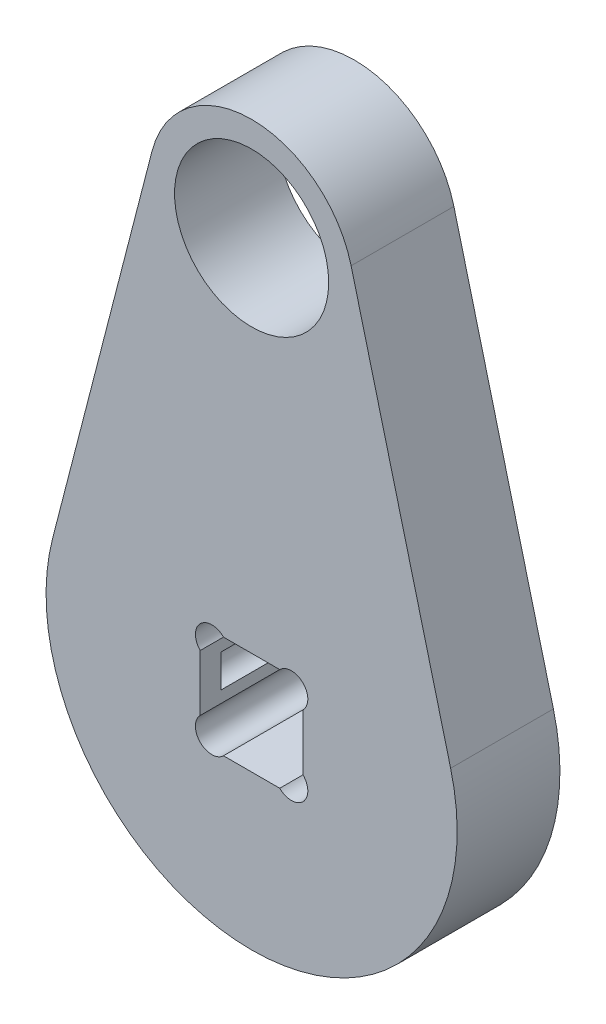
ISO-10303-21;
HEADER;
FILE_DESCRIPTION(('STEP AP214'),'2;1');
FILE_NAME('part.step','',(''),(''),'','','');
FILE_SCHEMA(('AUTOMOTIVE_DESIGN { 1 0 10303 214 1 1 1 1 }'));
ENDSEC;
DATA;
#1=APPLICATION_CONTEXT('core data for automotive mechanical design processes');
#2=APPLICATION_PROTOCOL_DEFINITION('international standard','automotive_design',2000,#1);
#3=PRODUCT_CONTEXT('',#1,'mechanical');
#4=PRODUCT('Part','Part','',(#3));
#5=PRODUCT_RELATED_PRODUCT_CATEGORY('part','',(#4));
#6=PRODUCT_DEFINITION_FORMATION('','',#4);
#7=PRODUCT_DEFINITION_CONTEXT('part definition',#1,'design');
#8=PRODUCT_DEFINITION('design','',#6,#7);
#9=PRODUCT_DEFINITION_SHAPE('','',#8);
#10=(LENGTH_UNIT() NAMED_UNIT(*) SI_UNIT(.MILLI.,.METRE.));
#11=(NAMED_UNIT(*) PLANE_ANGLE_UNIT() SI_UNIT($,.RADIAN.));
#12=(NAMED_UNIT(*) SI_UNIT($,.STERADIAN.) SOLID_ANGLE_UNIT());
#13=UNCERTAINTY_MEASURE_WITH_UNIT(LENGTH_MEASURE(1.E-05),#10,'distance_accuracy_value','');
#14=(GEOMETRIC_REPRESENTATION_CONTEXT(3) GLOBAL_UNCERTAINTY_ASSIGNED_CONTEXT((#13)) GLOBAL_UNIT_ASSIGNED_CONTEXT((#10,
#11,#12)) REPRESENTATION_CONTEXT('',''));
#15=CARTESIAN_POINT('',(0.,0.,0.));
#16=DIRECTION('',(0.,0.,1.));
#17=DIRECTION('',(1.,0.,0.));
#18=AXIS2_PLACEMENT_3D('',#15,#16,#17);
#19=CARTESIAN_POINT('',(0.,40.,10.));
#20=DIRECTION('',(0.,0.,1.));
#21=DIRECTION('',(1.,0.,0.));
#22=AXIS2_PLACEMENT_3D('',#19,#20,#21);
#23=PLANE('',#22);
#24=CARTESIAN_POINT('',(3.86862915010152,3.86862915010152,10.));
#25=DIRECTION('',(0.,0.,-1.));
#26=DIRECTION('',(-1.,0.,0.));
#27=AXIS2_PLACEMENT_3D('',#24,#25,#26);
#28=CIRCLE('',#27,1.6);
#29=CARTESIAN_POINT('',(2.73725830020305,5.,10.));
#30=VERTEX_POINT('',#29);
#31=CARTESIAN_POINT('',(5.,2.73725830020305,10.));
#32=VERTEX_POINT('',#31);
#33=EDGE_CURVE('E176',#30,#32,#28,.T.);
#34=ORIENTED_EDGE('',*,*,#33,.T.);
#35=DIRECTION('',(0.,-1.,0.));
#36=VECTOR('',#35,1.);
#37=CARTESIAN_POINT('',(5.,2.73725830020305,10.));
#38=LINE('',#37,#36);
#39=CARTESIAN_POINT('',(5.,-2.73725830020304,10.));
#40=VERTEX_POINT('',#39);
#41=EDGE_CURVE('E361',#32,#40,#38,.T.);
#42=ORIENTED_EDGE('',*,*,#41,.T.);
#43=CARTESIAN_POINT('',(3.86862915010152,-3.86862915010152,10.));
#44=DIRECTION('',(0.,0.,-1.));
#45=DIRECTION('',(1.,0.,0.));
#46=AXIS2_PLACEMENT_3D('',#43,#44,#45);
#47=CIRCLE('',#46,1.6);
#48=CARTESIAN_POINT('',(2.73725830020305,-5.,10.));
#49=VERTEX_POINT('',#48);
#50=EDGE_CURVE('E359',#40,#49,#47,.T.);
#51=ORIENTED_EDGE('',*,*,#50,.T.);
#52=DIRECTION('',(-1.,0.,0.));
#53=VECTOR('',#52,1.);
#54=CARTESIAN_POINT('',(2.73725830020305,-5.,10.));
#55=LINE('',#54,#53);
#56=CARTESIAN_POINT('',(-2.73725830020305,-5.,10.));
#57=VERTEX_POINT('',#56);
#58=EDGE_CURVE('E366',#49,#57,#55,.T.);
#59=ORIENTED_EDGE('',*,*,#58,.T.);
#60=CARTESIAN_POINT('',(-3.86862915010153,-3.86862915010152,10.));
#61=DIRECTION('',(0.,0.,-1.));
#62=DIRECTION('',(-1.,0.,0.));
#63=AXIS2_PLACEMENT_3D('',#60,#61,#62);
#64=CIRCLE('',#63,1.6);
#65=CARTESIAN_POINT('',(-5.,-2.73725830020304,10.));
#66=VERTEX_POINT('',#65);
#67=EDGE_CURVE('E372',#57,#66,#64,.T.);
#68=ORIENTED_EDGE('',*,*,#67,.T.);
#69=DIRECTION('',(0.,1.,0.));
#70=VECTOR('',#69,1.);
#71=CARTESIAN_POINT('',(-5.,2.73725830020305,10.));
#72=LINE('',#71,#70);
#73=CARTESIAN_POINT('',(-5.,2.73725830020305,10.));
#74=VERTEX_POINT('',#73);
#75=EDGE_CURVE('E375',#66,#74,#72,.T.);
#76=ORIENTED_EDGE('',*,*,#75,.T.);
#77=CARTESIAN_POINT('',(-3.86862915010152,3.86862915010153,10.));
#78=DIRECTION('',(0.,0.,-1.));
#79=DIRECTION('',(1.,0.,0.));
#80=AXIS2_PLACEMENT_3D('',#77,#78,#79);
#81=CIRCLE('',#80,1.6);
#82=CARTESIAN_POINT('',(-2.73725830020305,5.,10.));
#83=VERTEX_POINT('',#82);
#84=EDGE_CURVE('E378',#74,#83,#81,.T.);
#85=ORIENTED_EDGE('',*,*,#84,.T.);
#86=DIRECTION('',(1.,0.,0.));
#87=VECTOR('',#86,1.);
#88=CARTESIAN_POINT('',(2.73725830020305,5.,10.));
#89=LINE('',#88,#87);
#90=EDGE_CURVE('E196',#83,#30,#89,.T.);
#91=ORIENTED_EDGE('',*,*,#90,.T.);
#92=EDGE_LOOP('',(#34,#42,#51,#59,#68,#76,#85,#91));
#93=FACE_BOUND('',#92,.T.);
#94=CARTESIAN_POINT('',(0.,40.,10.));
#95=DIRECTION('',(0.,0.,1.));
#96=DIRECTION('',(1.,0.,0.));
#97=AXIS2_PLACEMENT_3D('',#94,#95,#96);
#98=CIRCLE('',#97,10.0000000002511);
#99=CARTESIAN_POINT('',(9.68245836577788,42.5,10.));
#100=VERTEX_POINT('',#99);
#101=CARTESIAN_POINT('',(-9.68245836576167,42.5000000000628,10.));
#102=VERTEX_POINT('',#101);
#103=EDGE_CURVE('E203',#100,#102,#98,.T.);
#104=ORIENTED_EDGE('',*,*,#103,.T.);
#105=DIRECTION('',(-0.249999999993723,-0.968245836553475,0.));
#106=VECTOR('',#105,1.);
#107=CARTESIAN_POINT('',(-9.68245836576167,42.5000000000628,10.));
#108=LINE('',#107,#106);
#109=CARTESIAN_POINT('',(-19.3649167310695,4.99999999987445,10.));
#110=VERTEX_POINT('',#109);
#111=EDGE_CURVE('E206',#102,#110,#108,.T.);
#112=ORIENTED_EDGE('',*,*,#111,.T.);
#113=CARTESIAN_POINT('',(0.,0.,10.));
#114=DIRECTION('',(0.,0.,1.));
#115=DIRECTION('',(1.,0.,0.));
#116=AXIS2_PLACEMENT_3D('',#113,#114,#115);
#117=CIRCLE('',#116,20.);
#118=CARTESIAN_POINT('',(19.3649167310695,4.99999999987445,10.));
#119=VERTEX_POINT('',#118);
#120=EDGE_CURVE('E209',#110,#119,#117,.T.);
#121=ORIENTED_EDGE('',*,*,#120,.T.);
#122=DIRECTION('',(-0.249999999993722,0.968245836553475,0.));
#123=VECTOR('',#122,1.);
#124=CARTESIAN_POINT('',(9.68245836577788,42.5,10.));
#125=LINE('',#124,#123);
#126=EDGE_CURVE('E211',#119,#100,#125,.T.);
#127=ORIENTED_EDGE('',*,*,#126,.T.);
#128=EDGE_LOOP('',(#104,#112,#121,#127));
#129=FACE_BOUND('',#128,.T.);
#130=CARTESIAN_POINT('',(0.,40.,10.));
#131=DIRECTION('',(0.,0.,1.));
#132=DIRECTION('',(1.,0.,0.));
#133=AXIS2_PLACEMENT_3D('',#130,#131,#132);
#134=CIRCLE('',#133,7.5);
#135=CARTESIAN_POINT('',(7.5,40.,10.));
#136=VERTEX_POINT('',#135);
#137=EDGE_CURVE('E197',#136,#136,#134,.T.);
#138=ORIENTED_EDGE('',*,*,#137,.F.);
#139=EDGE_LOOP('',(#138));
#140=FACE_BOUND('',#139,.T.);
#141=ADVANCED_FACE('F32',(#93,#129,#140),#23,.T.);
#142=CARTESIAN_POINT('',(0.,40.,0.));
#143=DIRECTION('',(0.,0.,1.));
#144=DIRECTION('',(1.,0.,0.));
#145=AXIS2_PLACEMENT_3D('',#142,#143,#144);
#146=PLANE('',#145);
#147=DIRECTION('',(0.,1.,0.));
#148=VECTOR('',#147,1.);
#149=CARTESIAN_POINT('',(-5.,2.73725830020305,0.));
#150=LINE('',#149,#148);
#151=CARTESIAN_POINT('',(-5.,1.6,0.));
#152=VERTEX_POINT('',#151);
#153=CARTESIAN_POINT('',(-5.,2.73725830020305,0.));
#154=VERTEX_POINT('',#153);
#155=EDGE_CURVE('E159',#152,#154,#150,.T.);
#156=ORIENTED_EDGE('',*,*,#155,.F.);
#157=CARTESIAN_POINT('',(-5.,0.,0.));
#158=DIRECTION('',(0.,0.,-1.));
#159=DIRECTION('',(1.,0.,0.));
#160=AXIS2_PLACEMENT_3D('',#157,#158,#159);
#161=CIRCLE('',#160,1.6);
#162=CARTESIAN_POINT('',(-5.,-1.6,0.));
#163=VERTEX_POINT('',#162);
#164=EDGE_CURVE('E146',#163,#152,#161,.T.);
#165=ORIENTED_EDGE('',*,*,#164,.F.);
#166=CARTESIAN_POINT('',(-5.,-2.73725830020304,0.));
#167=VERTEX_POINT('',#166);
#168=EDGE_CURVE('E157',#167,#163,#150,.T.);
#169=ORIENTED_EDGE('',*,*,#168,.F.);
#170=CARTESIAN_POINT('',(-3.86862915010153,-3.86862915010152,0.));
#171=DIRECTION('',(0.,0.,-1.));
#172=DIRECTION('',(-1.,0.,0.));
#173=AXIS2_PLACEMENT_3D('',#170,#171,#172);
#174=CIRCLE('',#173,1.6);
#175=CARTESIAN_POINT('',(-2.73725830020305,-5.,0.));
#176=VERTEX_POINT('',#175);
#177=EDGE_CURVE('E170',#176,#167,#174,.T.);
#178=ORIENTED_EDGE('',*,*,#177,.F.);
#179=DIRECTION('',(-1.,0.,0.));
#180=VECTOR('',#179,1.);
#181=CARTESIAN_POINT('',(2.73725830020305,-5.,0.));
#182=LINE('',#181,#180);
#183=CARTESIAN_POINT('',(2.73725830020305,-5.,0.));
#184=VERTEX_POINT('',#183);
#185=EDGE_CURVE('E347',#184,#176,#182,.T.);
#186=ORIENTED_EDGE('',*,*,#185,.F.);
#187=CARTESIAN_POINT('',(3.86862915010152,-3.86862915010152,0.));
#188=DIRECTION('',(0.,0.,-1.));
#189=DIRECTION('',(1.,0.,0.));
#190=AXIS2_PLACEMENT_3D('',#187,#188,#189);
#191=CIRCLE('',#190,1.6);
#192=CARTESIAN_POINT('',(5.,-2.73725830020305,0.));
#193=VERTEX_POINT('',#192);
#194=EDGE_CURVE('E343',#193,#184,#191,.T.);
#195=ORIENTED_EDGE('',*,*,#194,.F.);
#196=DIRECTION('',(0.,-1.,0.));
#197=VECTOR('',#196,1.);
#198=CARTESIAN_POINT('',(5.,2.73725830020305,0.));
#199=LINE('',#198,#197);
#200=CARTESIAN_POINT('',(5.,-1.6,0.));
#201=VERTEX_POINT('',#200);
#202=EDGE_CURVE('E344',#201,#193,#199,.T.);
#203=ORIENTED_EDGE('',*,*,#202,.F.);
#204=CARTESIAN_POINT('',(5.,0.,0.));
#205=DIRECTION('',(0.,0.,-1.));
#206=DIRECTION('',(-1.,0.,0.));
#207=AXIS2_PLACEMENT_3D('',#204,#205,#206);
#208=CIRCLE('',#207,1.6);
#209=CARTESIAN_POINT('',(5.,1.6,0.));
#210=VERTEX_POINT('',#209);
#211=EDGE_CURVE('E336',#210,#201,#208,.T.);
#212=ORIENTED_EDGE('',*,*,#211,.F.);
#213=CARTESIAN_POINT('',(5.,2.73725830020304,0.));
#214=VERTEX_POINT('',#213);
#215=EDGE_CURVE('E340',#214,#210,#199,.T.);
#216=ORIENTED_EDGE('',*,*,#215,.F.);
#217=CARTESIAN_POINT('',(3.86862915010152,3.86862915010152,0.));
#218=DIRECTION('',(0.,0.,-1.));
#219=DIRECTION('',(-1.,0.,0.));
#220=AXIS2_PLACEMENT_3D('',#217,#218,#219);
#221=CIRCLE('',#220,1.6);
#222=CARTESIAN_POINT('',(2.73725830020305,5.,0.));
#223=VERTEX_POINT('',#222);
#224=EDGE_CURVE('E335',#223,#214,#221,.T.);
#225=ORIENTED_EDGE('',*,*,#224,.F.);
#226=DIRECTION('',(1.,0.,0.));
#227=VECTOR('',#226,1.);
#228=CARTESIAN_POINT('',(2.73725830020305,5.,0.));
#229=LINE('',#228,#227);
#230=CARTESIAN_POINT('',(-2.73725830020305,5.,0.));
#231=VERTEX_POINT('',#230);
#232=EDGE_CURVE('E168',#231,#223,#229,.T.);
#233=ORIENTED_EDGE('',*,*,#232,.F.);
#234=CARTESIAN_POINT('',(-3.86862915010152,3.86862915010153,0.));
#235=DIRECTION('',(0.,0.,-1.));
#236=DIRECTION('',(1.,0.,0.));
#237=AXIS2_PLACEMENT_3D('',#234,#235,#236);
#238=CIRCLE('',#237,1.6);
#239=EDGE_CURVE('E165',#154,#231,#238,.T.);
#240=ORIENTED_EDGE('',*,*,#239,.F.);
#241=EDGE_LOOP('',(#156,#165,#169,#178,#186,#195,#203,#212,#216,#225,#233,#240));
#242=FACE_BOUND('',#241,.T.);
#243=CARTESIAN_POINT('',(0.,40.,0.));
#244=DIRECTION('',(0.,0.,1.));
#245=DIRECTION('',(1.,0.,0.));
#246=AXIS2_PLACEMENT_3D('',#243,#244,#245);
#247=CIRCLE('',#246,10.0000000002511);
#248=CARTESIAN_POINT('',(9.68245836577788,42.5,0.));
#249=VERTEX_POINT('',#248);
#250=CARTESIAN_POINT('',(-9.68245836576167,42.5000000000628,0.));
#251=VERTEX_POINT('',#250);
#252=EDGE_CURVE('E200',#249,#251,#247,.T.);
#253=ORIENTED_EDGE('',*,*,#252,.F.);
#254=DIRECTION('',(-0.249999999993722,0.968245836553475,0.));
#255=VECTOR('',#254,1.);
#256=CARTESIAN_POINT('',(9.68245836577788,42.5,0.));
#257=LINE('',#256,#255);
#258=CARTESIAN_POINT('',(19.3649167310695,4.99999999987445,0.));
#259=VERTEX_POINT('',#258);
#260=EDGE_CURVE('E207',#259,#249,#257,.T.);
#261=ORIENTED_EDGE('',*,*,#260,.F.);
#262=CARTESIAN_POINT('',(0.,0.,0.));
#263=DIRECTION('',(0.,0.,1.));
#264=DIRECTION('',(1.,0.,0.));
#265=AXIS2_PLACEMENT_3D('',#262,#263,#264);
#266=CIRCLE('',#265,20.);
#267=CARTESIAN_POINT('',(-19.3649167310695,4.99999999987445,0.));
#268=VERTEX_POINT('',#267);
#269=EDGE_CURVE('E218',#268,#259,#266,.T.);
#270=ORIENTED_EDGE('',*,*,#269,.F.);
#271=DIRECTION('',(-0.249999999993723,-0.968245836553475,0.));
#272=VECTOR('',#271,1.);
#273=CARTESIAN_POINT('',(-9.68245836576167,42.5000000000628,0.));
#274=LINE('',#273,#272);
#275=EDGE_CURVE('E216',#251,#268,#274,.T.);
#276=ORIENTED_EDGE('',*,*,#275,.F.);
#277=EDGE_LOOP('',(#253,#261,#270,#276));
#278=FACE_BOUND('',#277,.T.);
#279=CARTESIAN_POINT('',(0.,40.,0.));
#280=DIRECTION('',(0.,0.,1.));
#281=DIRECTION('',(1.,0.,0.));
#282=AXIS2_PLACEMENT_3D('',#279,#280,#281);
#283=CIRCLE('',#282,7.5);
#284=CARTESIAN_POINT('',(7.5,40.,0.));
#285=VERTEX_POINT('',#284);
#286=EDGE_CURVE('E179',#285,#285,#283,.T.);
#287=ORIENTED_EDGE('',*,*,#286,.T.);
#288=EDGE_LOOP('',(#287));
#289=FACE_BOUND('',#288,.T.);
#290=ADVANCED_FACE('F154',(#242,#278,#289),#146,.F.);
#291=CARTESIAN_POINT('',(0.,40.,10.));
#292=DIRECTION('',(0.,0.,-1.));
#293=DIRECTION('',(-1.,0.,0.));
#294=AXIS2_PLACEMENT_3D('',#291,#292,#293);
#295=CYLINDRICAL_SURFACE('',#294,10.0000000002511);
#296=ORIENTED_EDGE('',*,*,#252,.T.);
#297=DIRECTION('',(0.,0.,-1.));
#298=VECTOR('',#297,1.);
#299=CARTESIAN_POINT('',(-9.68245836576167,42.5000000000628,10.));
#300=LINE('',#299,#298);
#301=EDGE_CURVE('E229',#102,#251,#300,.T.);
#302=ORIENTED_EDGE('',*,*,#301,.F.);
#303=ORIENTED_EDGE('',*,*,#103,.F.);
#304=DIRECTION('',(0.,0.,-1.));
#305=VECTOR('',#304,1.);
#306=CARTESIAN_POINT('',(9.68245836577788,42.5,10.));
#307=LINE('',#306,#305);
#308=EDGE_CURVE('E213',#100,#249,#307,.T.);
#309=ORIENTED_EDGE('',*,*,#308,.T.);
#310=EDGE_LOOP('',(#296,#302,#303,#309));
#311=FACE_BOUND('',#310,.T.);
#312=ADVANCED_FACE('F34',(#311),#295,.T.);
#313=CARTESIAN_POINT('',(-9.68245836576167,42.5000000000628,10.));
#314=DIRECTION('',(0.968245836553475,-0.249999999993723,0.));
#315=DIRECTION('',(0.249999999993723,0.968245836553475,0.));
#316=AXIS2_PLACEMENT_3D('',#313,#314,#315);
#317=PLANE('',#316);
#318=ORIENTED_EDGE('',*,*,#275,.T.);
#319=DIRECTION('',(0.,0.,-1.));
#320=VECTOR('',#319,1.);
#321=CARTESIAN_POINT('',(-19.3649167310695,4.99999999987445,10.));
#322=LINE('',#321,#320);
#323=EDGE_CURVE('E226',#110,#268,#322,.T.);
#324=ORIENTED_EDGE('',*,*,#323,.F.);
#325=ORIENTED_EDGE('',*,*,#111,.F.);
#326=ORIENTED_EDGE('',*,*,#301,.T.);
#327=EDGE_LOOP('',(#318,#324,#325,#326));
#328=FACE_BOUND('',#327,.T.);
#329=ADVANCED_FACE('F267',(#328),#317,.F.);
#330=CARTESIAN_POINT('',(0.,0.,10.));
#331=DIRECTION('',(0.,0.,-1.));
#332=DIRECTION('',(-1.,0.,0.));
#333=AXIS2_PLACEMENT_3D('',#330,#331,#332);
#334=CYLINDRICAL_SURFACE('',#333,20.);
#335=ORIENTED_EDGE('',*,*,#269,.T.);
#336=DIRECTION('',(0.,0.,-1.));
#337=VECTOR('',#336,1.);
#338=CARTESIAN_POINT('',(19.3649167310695,4.99999999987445,10.));
#339=LINE('',#338,#337);
#340=EDGE_CURVE('E223',#119,#259,#339,.T.);
#341=ORIENTED_EDGE('',*,*,#340,.F.);
#342=ORIENTED_EDGE('',*,*,#120,.F.);
#343=ORIENTED_EDGE('',*,*,#323,.T.);
#344=EDGE_LOOP('',(#335,#341,#342,#343));
#345=FACE_BOUND('',#344,.T.);
#346=ADVANCED_FACE('F264',(#345),#334,.T.);
#347=CARTESIAN_POINT('',(9.68245836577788,42.5,10.));
#348=DIRECTION('',(-0.968245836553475,-0.249999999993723,0.));
#349=DIRECTION('',(0.249999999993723,-0.968245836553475,0.));
#350=AXIS2_PLACEMENT_3D('',#347,#348,#349);
#351=PLANE('',#350);
#352=ORIENTED_EDGE('',*,*,#260,.T.);
#353=ORIENTED_EDGE('',*,*,#308,.F.);
#354=ORIENTED_EDGE('',*,*,#126,.F.);
#355=ORIENTED_EDGE('',*,*,#340,.T.);
#356=EDGE_LOOP('',(#352,#353,#354,#355));
#357=FACE_BOUND('',#356,.T.);
#358=ADVANCED_FACE('F261',(#357),#351,.F.);
#359=CARTESIAN_POINT('',(0.,40.,10.));
#360=DIRECTION('',(0.,0.,-1.));
#361=DIRECTION('',(-1.,0.,0.));
#362=AXIS2_PLACEMENT_3D('',#359,#360,#361);
#363=CYLINDRICAL_SURFACE('',#362,7.5);
#364=ORIENTED_EDGE('',*,*,#137,.T.);
#365=EDGE_LOOP('',(#364));
#366=FACE_BOUND('',#365,.T.);
#367=ORIENTED_EDGE('',*,*,#286,.F.);
#368=EDGE_LOOP('',(#367));
#369=FACE_BOUND('',#368,.T.);
#370=ADVANCED_FACE('F258',(#366,#369),#363,.F.);
#371=CARTESIAN_POINT('',(3.86862915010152,3.86862915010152,10.));
#372=DIRECTION('',(0.,0.,-1.));
#373=DIRECTION('',(-1.,0.,0.));
#374=AXIS2_PLACEMENT_3D('',#371,#372,#373);
#375=CYLINDRICAL_SURFACE('',#374,1.6);
#376=ORIENTED_EDGE('',*,*,#224,.T.);
#377=DIRECTION('',(0.,0.,-1.));
#378=VECTOR('',#377,1.);
#379=CARTESIAN_POINT('',(5.,2.73725830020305,10.));
#380=LINE('',#379,#378);
#381=EDGE_CURVE('E193',#32,#214,#380,.T.);
#382=ORIENTED_EDGE('',*,*,#381,.F.);
#383=ORIENTED_EDGE('',*,*,#33,.F.);
#384=DIRECTION('',(0.,0.,-1.));
#385=VECTOR('',#384,1.);
#386=CARTESIAN_POINT('',(2.73725830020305,5.,10.));
#387=LINE('',#386,#385);
#388=EDGE_CURVE('E177',#30,#223,#387,.T.);
#389=ORIENTED_EDGE('',*,*,#388,.T.);
#390=EDGE_LOOP('',(#376,#382,#383,#389));
#391=FACE_BOUND('',#390,.T.);
#392=ADVANCED_FACE('F291',(#391),#375,.F.);
#393=CARTESIAN_POINT('',(2.73725830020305,5.,10.));
#394=DIRECTION('',(0.,1.,0.));
#395=DIRECTION('',(0.,0.,1.));
#396=AXIS2_PLACEMENT_3D('',#393,#394,#395);
#397=PLANE('',#396);
#398=ORIENTED_EDGE('',*,*,#232,.T.);
#399=ORIENTED_EDGE('',*,*,#388,.F.);
#400=ORIENTED_EDGE('',*,*,#90,.F.);
#401=DIRECTION('',(0.,0.,-1.));
#402=VECTOR('',#401,1.);
#403=CARTESIAN_POINT('',(-2.73725830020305,5.,10.));
#404=LINE('',#403,#402);
#405=EDGE_CURVE('E180',#83,#231,#404,.T.);
#406=ORIENTED_EDGE('',*,*,#405,.T.);
#407=EDGE_LOOP('',(#398,#399,#400,#406));
#408=FACE_BOUND('',#407,.T.);
#409=ADVANCED_FACE('F296',(#408),#397,.F.);
#410=CARTESIAN_POINT('',(-3.86862915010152,3.86862915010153,10.));
#411=DIRECTION('',(0.,0.,-1.));
#412=DIRECTION('',(-1.,0.,0.));
#413=AXIS2_PLACEMENT_3D('',#410,#411,#412);
#414=CYLINDRICAL_SURFACE('',#413,1.6);
#415=ORIENTED_EDGE('',*,*,#239,.T.);
#416=ORIENTED_EDGE('',*,*,#405,.F.);
#417=ORIENTED_EDGE('',*,*,#84,.F.);
#418=DIRECTION('',(0.,0.,-1.));
#419=VECTOR('',#418,1.);
#420=CARTESIAN_POINT('',(-5.,2.73725830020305,10.));
#421=LINE('',#420,#419);
#422=EDGE_CURVE('E182',#74,#154,#421,.T.);
#423=ORIENTED_EDGE('',*,*,#422,.T.);
#424=EDGE_LOOP('',(#415,#416,#417,#423));
#425=FACE_BOUND('',#424,.T.);
#426=ADVANCED_FACE('F301',(#425),#414,.F.);
#427=CARTESIAN_POINT('',(-5.,2.73725830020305,10.));
#428=DIRECTION('',(-1.,0.,0.));
#429=DIRECTION('',(0.,-1.,0.));
#430=AXIS2_PLACEMENT_3D('',#427,#428,#429);
#431=PLANE('',#430);
#432=DIRECTION('',(0.,1.,0.));
#433=VECTOR('',#432,1.);
#434=CARTESIAN_POINT('',(-5.,2.73725830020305,8.));
#435=LINE('',#434,#433);
#436=CARTESIAN_POINT('',(-5.,-1.6,8.));
#437=VERTEX_POINT('',#436);
#438=CARTESIAN_POINT('',(-5.,1.6,8.));
#439=VERTEX_POINT('',#438);
#440=EDGE_CURVE('E150',#437,#439,#435,.T.);
#441=ORIENTED_EDGE('',*,*,#440,.T.);
#442=DIRECTION('',(0.,0.,-1.));
#443=VECTOR('',#442,1.);
#444=CARTESIAN_POINT('',(-5.,1.6,8.));
#445=LINE('',#444,#443);
#446=EDGE_CURVE('E11',#439,#152,#445,.T.);
#447=ORIENTED_EDGE('',*,*,#446,.T.);
#448=ORIENTED_EDGE('',*,*,#155,.T.);
#449=ORIENTED_EDGE('',*,*,#422,.F.);
#450=ORIENTED_EDGE('',*,*,#75,.F.);
#451=DIRECTION('',(0.,0.,-1.));
#452=VECTOR('',#451,1.);
#453=CARTESIAN_POINT('',(-5.,-2.73725830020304,10.));
#454=LINE('',#453,#452);
#455=EDGE_CURVE('E163',#66,#167,#454,.T.);
#456=ORIENTED_EDGE('',*,*,#455,.T.);
#457=ORIENTED_EDGE('',*,*,#168,.T.);
#458=DIRECTION('',(0.,0.,-1.));
#459=VECTOR('',#458,1.);
#460=CARTESIAN_POINT('',(-5.,-1.6,8.));
#461=LINE('',#460,#459);
#462=EDGE_CURVE('E40',#163,#437,#461,.F.);
#463=ORIENTED_EDGE('',*,*,#462,.T.);
#464=EDGE_LOOP('',(#441,#447,#448,#449,#450,#456,#457,#463));
#465=FACE_BOUND('',#464,.T.);
#466=ADVANCED_FACE('F161',(#465),#431,.F.);
#467=CARTESIAN_POINT('',(-3.86862915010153,-3.86862915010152,10.));
#468=DIRECTION('',(0.,0.,-1.));
#469=DIRECTION('',(-1.,0.,0.));
#470=AXIS2_PLACEMENT_3D('',#467,#468,#469);
#471=CYLINDRICAL_SURFACE('',#470,1.6);
#472=ORIENTED_EDGE('',*,*,#177,.T.);
#473=ORIENTED_EDGE('',*,*,#455,.F.);
#474=ORIENTED_EDGE('',*,*,#67,.F.);
#475=DIRECTION('',(0.,0.,-1.));
#476=VECTOR('',#475,1.);
#477=CARTESIAN_POINT('',(-2.73725830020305,-5.,10.));
#478=LINE('',#477,#476);
#479=EDGE_CURVE('E186',#57,#176,#478,.T.);
#480=ORIENTED_EDGE('',*,*,#479,.T.);
#481=EDGE_LOOP('',(#472,#473,#474,#480));
#482=FACE_BOUND('',#481,.T.);
#483=ADVANCED_FACE('F317',(#482),#471,.F.);
#484=CARTESIAN_POINT('',(2.73725830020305,-5.,10.));
#485=DIRECTION('',(0.,-1.,0.));
#486=DIRECTION('',(1.,0.,0.));
#487=AXIS2_PLACEMENT_3D('',#484,#485,#486);
#488=PLANE('',#487);
#489=ORIENTED_EDGE('',*,*,#185,.T.);
#490=ORIENTED_EDGE('',*,*,#479,.F.);
#491=ORIENTED_EDGE('',*,*,#58,.F.);
#492=DIRECTION('',(0.,0.,-1.));
#493=VECTOR('',#492,1.);
#494=CARTESIAN_POINT('',(2.73725830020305,-5.,10.));
#495=LINE('',#494,#493);
#496=EDGE_CURVE('E188',#49,#184,#495,.T.);
#497=ORIENTED_EDGE('',*,*,#496,.T.);
#498=EDGE_LOOP('',(#489,#490,#491,#497));
#499=FACE_BOUND('',#498,.T.);
#500=ADVANCED_FACE('F313',(#499),#488,.F.);
#501=CARTESIAN_POINT('',(3.86862915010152,-3.86862915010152,10.));
#502=DIRECTION('',(0.,0.,-1.));
#503=DIRECTION('',(-1.,0.,0.));
#504=AXIS2_PLACEMENT_3D('',#501,#502,#503);
#505=CYLINDRICAL_SURFACE('',#504,1.6);
#506=ORIENTED_EDGE('',*,*,#194,.T.);
#507=ORIENTED_EDGE('',*,*,#496,.F.);
#508=ORIENTED_EDGE('',*,*,#50,.F.);
#509=DIRECTION('',(0.,0.,-1.));
#510=VECTOR('',#509,1.);
#511=CARTESIAN_POINT('',(5.,-2.73725830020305,10.));
#512=LINE('',#511,#510);
#513=EDGE_CURVE('E190',#40,#193,#512,.T.);
#514=ORIENTED_EDGE('',*,*,#513,.T.);
#515=EDGE_LOOP('',(#506,#507,#508,#514));
#516=FACE_BOUND('',#515,.T.);
#517=ADVANCED_FACE('F309',(#516),#505,.F.);
#518=CARTESIAN_POINT('',(5.,2.73725830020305,10.));
#519=DIRECTION('',(1.,0.,0.));
#520=DIRECTION('',(0.,0.,-1.));
#521=AXIS2_PLACEMENT_3D('',#518,#519,#520);
#522=PLANE('',#521);
#523=DIRECTION('',(0.,1.,0.));
#524=VECTOR('',#523,1.);
#525=CARTESIAN_POINT('',(5.,2.73725830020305,8.));
#526=LINE('',#525,#524);
#527=CARTESIAN_POINT('',(5.,-1.6,8.));
#528=VERTEX_POINT('',#527);
#529=CARTESIAN_POINT('',(5.,1.6,8.));
#530=VERTEX_POINT('',#529);
#531=EDGE_CURVE('E232',#528,#530,#526,.T.);
#532=ORIENTED_EDGE('',*,*,#531,.F.);
#533=DIRECTION('',(0.,0.,-1.));
#534=VECTOR('',#533,1.);
#535=CARTESIAN_POINT('',(5.,-1.6,8.));
#536=LINE('',#535,#534);
#537=EDGE_CURVE('E237',#528,#201,#536,.T.);
#538=ORIENTED_EDGE('',*,*,#537,.T.);
#539=ORIENTED_EDGE('',*,*,#202,.T.);
#540=ORIENTED_EDGE('',*,*,#513,.F.);
#541=ORIENTED_EDGE('',*,*,#41,.F.);
#542=ORIENTED_EDGE('',*,*,#381,.T.);
#543=ORIENTED_EDGE('',*,*,#215,.T.);
#544=DIRECTION('',(0.,0.,-1.));
#545=VECTOR('',#544,1.);
#546=CARTESIAN_POINT('',(5.,1.6,8.));
#547=LINE('',#546,#545);
#548=EDGE_CURVE('E234',#210,#530,#547,.F.);
#549=ORIENTED_EDGE('',*,*,#548,.T.);
#550=EDGE_LOOP('',(#532,#538,#539,#540,#541,#542,#543,#549));
#551=FACE_BOUND('',#550,.T.);
#552=ADVANCED_FACE('F305',(#551),#522,.F.);
#553=CARTESIAN_POINT('',(5.,0.,8.));
#554=DIRECTION('',(0.,0.,-1.));
#555=DIRECTION('',(-1.,0.,0.));
#556=AXIS2_PLACEMENT_3D('',#553,#554,#555);
#557=CYLINDRICAL_SURFACE('',#556,1.6);
#558=CARTESIAN_POINT('',(5.,0.,8.));
#559=DIRECTION('',(0.,0.,-1.));
#560=DIRECTION('',(-1.,0.,0.));
#561=AXIS2_PLACEMENT_3D('',#558,#559,#560);
#562=CIRCLE('',#561,1.6);
#563=EDGE_CURVE('E53',#530,#528,#562,.T.);
#564=ORIENTED_EDGE('',*,*,#563,.F.);
#565=ORIENTED_EDGE('',*,*,#548,.F.);
#566=ORIENTED_EDGE('',*,*,#211,.T.);
#567=ORIENTED_EDGE('',*,*,#537,.F.);
#568=EDGE_LOOP('',(#564,#565,#566,#567));
#569=FACE_BOUND('',#568,.T.);
#570=ADVANCED_FACE('F308',(#569),#557,.F.);
#571=CARTESIAN_POINT('',(5.,0.,8.));
#572=DIRECTION('',(0.,0.,-1.));
#573=DIRECTION('',(-1.,0.,0.));
#574=AXIS2_PLACEMENT_3D('',#571,#572,#573);
#575=PLANE('',#574);
#576=ORIENTED_EDGE('',*,*,#531,.T.);
#577=ORIENTED_EDGE('',*,*,#563,.T.);
#578=EDGE_LOOP('',(#576,#577));
#579=FACE_BOUND('',#578,.T.);
#580=ADVANCED_FACE('F246',(#579),#575,.T.);
#581=CARTESIAN_POINT('',(-5.,0.,8.));
#582=DIRECTION('',(0.,0.,-1.));
#583=DIRECTION('',(-1.,0.,0.));
#584=AXIS2_PLACEMENT_3D('',#581,#582,#583);
#585=CYLINDRICAL_SURFACE('',#584,1.6);
#586=CARTESIAN_POINT('',(-5.,0.,8.));
#587=DIRECTION('',(0.,0.,-1.));
#588=DIRECTION('',(1.,0.,0.));
#589=AXIS2_PLACEMENT_3D('',#586,#587,#588);
#590=CIRCLE('',#589,1.6);
#591=EDGE_CURVE('E46',#437,#439,#590,.T.);
#592=ORIENTED_EDGE('',*,*,#591,.F.);
#593=ORIENTED_EDGE('',*,*,#462,.F.);
#594=ORIENTED_EDGE('',*,*,#164,.T.);
#595=ORIENTED_EDGE('',*,*,#446,.F.);
#596=EDGE_LOOP('',(#592,#593,#594,#595));
#597=FACE_BOUND('',#596,.T.);
#598=ADVANCED_FACE('F145',(#597),#585,.F.);
#599=CARTESIAN_POINT('',(-5.,0.,8.));
#600=DIRECTION('',(0.,0.,1.));
#601=DIRECTION('',(1.,0.,0.));
#602=AXIS2_PLACEMENT_3D('',#599,#600,#601);
#603=PLANE('',#602);
#604=ORIENTED_EDGE('',*,*,#591,.T.);
#605=ORIENTED_EDGE('',*,*,#440,.F.);
#606=EDGE_LOOP('',(#604,#605));
#607=FACE_BOUND('',#606,.T.);
#608=ADVANCED_FACE('F240',(#607),#603,.F.);
#609=CLOSED_SHELL('',(#141,#290,#312,#329,#346,#358,#370,#392,#409,#426,#466,#483,#500,#517,
#552,#570,#580,#598,#608));
#610=MANIFOLD_SOLID_BREP('B2',#609);
#611=ADVANCED_BREP_SHAPE_REPRESENTATION('',(#18,#610),#14);
#612=SHAPE_DEFINITION_REPRESENTATION(#9,#611);
ENDSEC;
END-ISO-10303-21;
